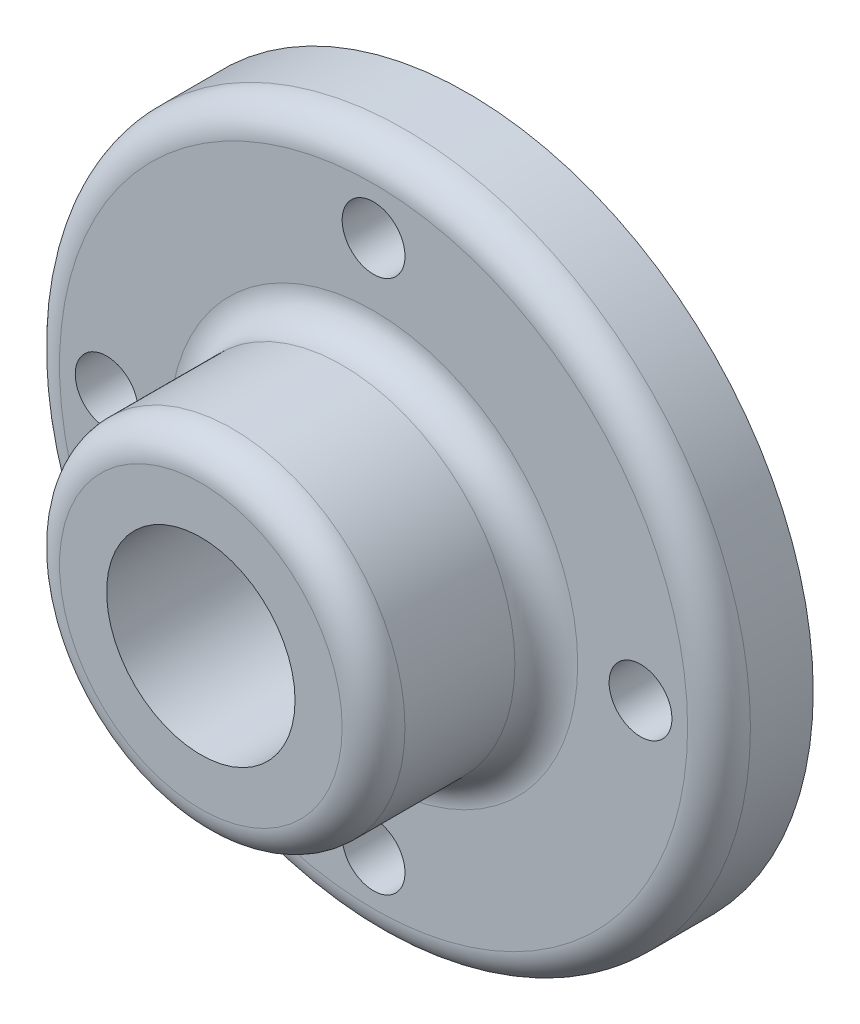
ISO-10303-21;
HEADER;
FILE_DESCRIPTION(('STEP AP214'),'2;1');
FILE_NAME('part.step','',(''),(''),'','','');
FILE_SCHEMA(('AUTOMOTIVE_DESIGN { 1 0 10303 214 1 1 1 1 }'));
ENDSEC;
DATA;
#1=APPLICATION_CONTEXT('core data for automotive mechanical design processes');
#2=APPLICATION_PROTOCOL_DEFINITION('international standard','automotive_design',2000,#1);
#3=PRODUCT_CONTEXT('',#1,'mechanical');
#4=PRODUCT('Part','Part','',(#3));
#5=PRODUCT_RELATED_PRODUCT_CATEGORY('part','',(#4));
#6=PRODUCT_DEFINITION_FORMATION('','',#4);
#7=PRODUCT_DEFINITION_CONTEXT('part definition',#1,'design');
#8=PRODUCT_DEFINITION('design','',#6,#7);
#9=PRODUCT_DEFINITION_SHAPE('','',#8);
#10=(LENGTH_UNIT() NAMED_UNIT(*) SI_UNIT(.MILLI.,.METRE.));
#11=(NAMED_UNIT(*) PLANE_ANGLE_UNIT() SI_UNIT($,.RADIAN.));
#12=(NAMED_UNIT(*) SI_UNIT($,.STERADIAN.) SOLID_ANGLE_UNIT());
#13=UNCERTAINTY_MEASURE_WITH_UNIT(LENGTH_MEASURE(1.E-05),#10,'distance_accuracy_value','');
#14=(GEOMETRIC_REPRESENTATION_CONTEXT(3) GLOBAL_UNCERTAINTY_ASSIGNED_CONTEXT((#13)) GLOBAL_UNIT_ASSIGNED_CONTEXT((#10,
#11,#12)) REPRESENTATION_CONTEXT('',''));
#15=CARTESIAN_POINT('',(0.,0.,0.));
#16=DIRECTION('',(0.,0.,1.));
#17=DIRECTION('',(1.,0.,0.));
#18=AXIS2_PLACEMENT_3D('',#15,#16,#17);
#19=CARTESIAN_POINT('',(0.,0.,0.));
#20=DIRECTION('',(0.,0.,-1.));
#21=DIRECTION('',(-1.,0.,0.));
#22=AXIS2_PLACEMENT_3D('',#19,#20,#21);
#23=PLANE('',#22);
#24=CARTESIAN_POINT('',(53.975,5.65358115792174E-13,0.));
#25=DIRECTION('',(0.,0.,1.));
#26=DIRECTION('',(0.,-1.,0.));
#27=AXIS2_PLACEMENT_3D('',#24,#25,#26);
#28=CIRCLE('',#27,6.35);
#29=CARTESIAN_POINT('',(53.9750000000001,-6.34999999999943,0.));
#30=VERTEX_POINT('',#29);
#31=EDGE_CURVE('E81',#30,#30,#28,.T.);
#32=ORIENTED_EDGE('',*,*,#31,.T.);
#33=EDGE_LOOP('',(#32));
#34=FACE_BOUND('',#33,.T.);
#35=CARTESIAN_POINT('',(0.,-53.975,0.));
#36=DIRECTION('',(0.,0.,1.));
#37=DIRECTION('',(-1.,0.,0.));
#38=AXIS2_PLACEMENT_3D('',#35,#36,#37);
#39=CIRCLE('',#38,6.35);
#40=CARTESIAN_POINT('',(-6.35,-53.975,0.));
#41=VERTEX_POINT('',#40);
#42=EDGE_CURVE('E75',#41,#41,#39,.T.);
#43=ORIENTED_EDGE('',*,*,#42,.T.);
#44=EDGE_LOOP('',(#43));
#45=FACE_BOUND('',#44,.T.);
#46=CARTESIAN_POINT('',(-53.975,-1.88452705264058E-13,0.));
#47=DIRECTION('',(0.,0.,1.));
#48=DIRECTION('',(0.,1.,0.));
#49=AXIS2_PLACEMENT_3D('',#46,#47,#48);
#50=CIRCLE('',#49,6.35);
#51=CARTESIAN_POINT('',(-53.975,6.34999999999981,0.));
#52=VERTEX_POINT('',#51);
#53=EDGE_CURVE('E69',#52,#52,#50,.T.);
#54=ORIENTED_EDGE('',*,*,#53,.T.);
#55=EDGE_LOOP('',(#54));
#56=FACE_BOUND('',#55,.T.);
#57=CARTESIAN_POINT('',(0.,53.975,0.));
#58=DIRECTION('',(0.,0.,1.));
#59=DIRECTION('',(1.,0.,0.));
#60=AXIS2_PLACEMENT_3D('',#57,#58,#59);
#61=CIRCLE('',#60,6.35);
#62=CARTESIAN_POINT('',(6.35,53.975,0.));
#63=VERTEX_POINT('',#62);
#64=EDGE_CURVE('E63',#63,#63,#61,.T.);
#65=ORIENTED_EDGE('',*,*,#64,.T.);
#66=EDGE_LOOP('',(#65));
#67=FACE_BOUND('',#66,.T.);
#68=CARTESIAN_POINT('',(0.,0.,0.));
#69=DIRECTION('',(0.,0.,1.));
#70=DIRECTION('',(1.,0.,0.));
#71=AXIS2_PLACEMENT_3D('',#68,#69,#70);
#72=CIRCLE('',#71,19.05);
#73=CARTESIAN_POINT('',(19.05,0.,0.));
#74=VERTEX_POINT('',#73);
#75=EDGE_CURVE('E59',#74,#74,#72,.T.);
#76=ORIENTED_EDGE('',*,*,#75,.T.);
#77=EDGE_LOOP('',(#76));
#78=FACE_BOUND('',#77,.T.);
#79=CARTESIAN_POINT('',(0.,0.,0.));
#80=DIRECTION('',(0.,0.,1.));
#81=DIRECTION('',(1.,0.,0.));
#82=AXIS2_PLACEMENT_3D('',#79,#80,#81);
#83=CIRCLE('',#82,69.85);
#84=CARTESIAN_POINT('',(69.85,0.,0.));
#85=VERTEX_POINT('',#84);
#86=EDGE_CURVE('E56',#85,#85,#83,.T.);
#87=ORIENTED_EDGE('',*,*,#86,.F.);
#88=EDGE_LOOP('',(#87));
#89=FACE_BOUND('',#88,.T.);
#90=ADVANCED_FACE('F30',(#34,#45,#56,#67,#78,#89),#23,.T.);
#91=CARTESIAN_POINT('',(0.,0.,0.));
#92=DIRECTION('',(0.,0.,1.));
#93=DIRECTION('',(1.,0.,0.));
#94=AXIS2_PLACEMENT_3D('',#91,#92,#93);
#95=CYLINDRICAL_SURFACE('',#94,69.85);
#96=CARTESIAN_POINT('',(0.,0.,12.7));
#97=DIRECTION('',(0.,0.,1.));
#98=DIRECTION('',(1.,0.,0.));
#99=AXIS2_PLACEMENT_3D('',#96,#97,#98);
#100=CIRCLE('',#99,69.85);
#101=CARTESIAN_POINT('',(69.85,0.,12.7));
#102=VERTEX_POINT('',#101);
#103=EDGE_CURVE('E45',#102,#102,#100,.F.);
#104=ORIENTED_EDGE('',*,*,#103,.T.);
#105=EDGE_LOOP('',(#104));
#106=FACE_BOUND('',#105,.T.);
#107=ORIENTED_EDGE('',*,*,#86,.T.);
#108=EDGE_LOOP('',(#107));
#109=FACE_BOUND('',#108,.T.);
#110=ADVANCED_FACE('F103',(#106,#109),#95,.T.);
#111=CARTESIAN_POINT('',(69.85,0.,19.05));
#112=DIRECTION('',(0.,0.,1.));
#113=DIRECTION('',(1.,0.,0.));
#114=AXIS2_PLACEMENT_3D('',#111,#112,#113);
#115=PLANE('',#114);
#116=CARTESIAN_POINT('',(53.975,5.65358115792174E-13,19.05));
#117=DIRECTION('',(0.,0.,1.));
#118=DIRECTION('',(0.,-1.,0.));
#119=AXIS2_PLACEMENT_3D('',#116,#117,#118);
#120=CIRCLE('',#119,6.35);
#121=CARTESIAN_POINT('',(53.9750000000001,-6.34999999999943,19.05));
#122=VERTEX_POINT('',#121);
#123=EDGE_CURVE('E84',#122,#122,#120,.T.);
#124=ORIENTED_EDGE('',*,*,#123,.F.);
#125=EDGE_LOOP('',(#124));
#126=FACE_BOUND('',#125,.T.);
#127=CARTESIAN_POINT('',(0.,-53.975,19.05));
#128=DIRECTION('',(0.,0.,1.));
#129=DIRECTION('',(-1.,0.,0.));
#130=AXIS2_PLACEMENT_3D('',#127,#128,#129);
#131=CIRCLE('',#130,6.35);
#132=CARTESIAN_POINT('',(-6.35,-53.975,19.05));
#133=VERTEX_POINT('',#132);
#134=EDGE_CURVE('E78',#133,#133,#131,.T.);
#135=ORIENTED_EDGE('',*,*,#134,.F.);
#136=EDGE_LOOP('',(#135));
#137=FACE_BOUND('',#136,.T.);
#138=CARTESIAN_POINT('',(-53.975,-1.88452705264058E-13,19.05));
#139=DIRECTION('',(0.,0.,1.));
#140=DIRECTION('',(0.,1.,0.));
#141=AXIS2_PLACEMENT_3D('',#138,#139,#140);
#142=CIRCLE('',#141,6.35);
#143=CARTESIAN_POINT('',(-53.975,6.34999999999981,19.05));
#144=VERTEX_POINT('',#143);
#145=EDGE_CURVE('E72',#144,#144,#142,.T.);
#146=ORIENTED_EDGE('',*,*,#145,.F.);
#147=EDGE_LOOP('',(#146));
#148=FACE_BOUND('',#147,.T.);
#149=CARTESIAN_POINT('',(0.,53.975,19.05));
#150=DIRECTION('',(0.,0.,1.));
#151=DIRECTION('',(1.,0.,0.));
#152=AXIS2_PLACEMENT_3D('',#149,#150,#151);
#153=CIRCLE('',#152,6.35);
#154=CARTESIAN_POINT('',(6.35,53.975,19.05));
#155=VERTEX_POINT('',#154);
#156=EDGE_CURVE('E66',#155,#155,#153,.T.);
#157=ORIENTED_EDGE('',*,*,#156,.F.);
#158=EDGE_LOOP('',(#157));
#159=FACE_BOUND('',#158,.T.);
#160=CARTESIAN_POINT('',(0.,0.,19.05));
#161=DIRECTION('',(0.,0.,1.));
#162=DIRECTION('',(1.,0.,0.));
#163=AXIS2_PLACEMENT_3D('',#160,#161,#162);
#164=CIRCLE('',#163,63.5);
#165=CARTESIAN_POINT('',(63.5,0.,19.05));
#166=VERTEX_POINT('',#165);
#167=EDGE_CURVE('E50',#166,#166,#164,.T.);
#168=ORIENTED_EDGE('',*,*,#167,.T.);
#169=EDGE_LOOP('',(#168));
#170=FACE_BOUND('',#169,.T.);
#171=CARTESIAN_POINT('',(0.,0.,19.05));
#172=DIRECTION('',(0.,0.,1.));
#173=DIRECTION('',(1.,0.,0.));
#174=AXIS2_PLACEMENT_3D('',#171,#172,#173);
#175=CIRCLE('',#174,41.275);
#176=CARTESIAN_POINT('',(41.275,0.,19.05));
#177=VERTEX_POINT('',#176);
#178=EDGE_CURVE('E53',#177,#177,#175,.F.);
#179=ORIENTED_EDGE('',*,*,#178,.T.);
#180=EDGE_LOOP('',(#179));
#181=FACE_BOUND('',#180,.T.);
#182=ADVANCED_FACE('F99',(#126,#137,#148,#159,#170,#181),#115,.T.);
#183=CARTESIAN_POINT('',(0.,0.,0.));
#184=DIRECTION('',(0.,0.,1.));
#185=DIRECTION('',(1.,0.,0.));
#186=AXIS2_PLACEMENT_3D('',#183,#184,#185);
#187=CYLINDRICAL_SURFACE('',#186,34.925);
#188=CARTESIAN_POINT('',(0.,0.,25.4));
#189=DIRECTION('',(0.,0.,1.));
#190=DIRECTION('',(1.,0.,0.));
#191=AXIS2_PLACEMENT_3D('',#188,#189,#190);
#192=CIRCLE('',#191,34.925);
#193=CARTESIAN_POINT('',(34.925,0.,25.4));
#194=VERTEX_POINT('',#193);
#195=EDGE_CURVE('E37',#194,#194,#192,.T.);
#196=ORIENTED_EDGE('',*,*,#195,.T.);
#197=EDGE_LOOP('',(#196));
#198=FACE_BOUND('',#197,.T.);
#199=CARTESIAN_POINT('',(0.,0.,47.625));
#200=DIRECTION('',(0.,0.,1.));
#201=DIRECTION('',(1.,0.,0.));
#202=AXIS2_PLACEMENT_3D('',#199,#200,#201);
#203=CIRCLE('',#202,34.925);
#204=CARTESIAN_POINT('',(34.925,0.,47.625));
#205=VERTEX_POINT('',#204);
#206=EDGE_CURVE('E41',#205,#205,#203,.F.);
#207=ORIENTED_EDGE('',*,*,#206,.T.);
#208=EDGE_LOOP('',(#207));
#209=FACE_BOUND('',#208,.T.);
#210=ADVANCED_FACE('F102',(#198,#209),#187,.T.);
#211=CARTESIAN_POINT('',(34.925,0.,53.975));
#212=DIRECTION('',(0.,0.,1.));
#213=DIRECTION('',(1.,0.,0.));
#214=AXIS2_PLACEMENT_3D('',#211,#212,#213);
#215=PLANE('',#214);
#216=CARTESIAN_POINT('',(0.,0.,53.975));
#217=DIRECTION('',(0.,0.,1.));
#218=DIRECTION('',(1.,0.,0.));
#219=AXIS2_PLACEMENT_3D('',#216,#217,#218);
#220=CIRCLE('',#219,28.575);
#221=CARTESIAN_POINT('',(28.575,0.,53.975));
#222=VERTEX_POINT('',#221);
#223=EDGE_CURVE('E10',#222,#222,#220,.T.);
#224=ORIENTED_EDGE('',*,*,#223,.T.);
#225=EDGE_LOOP('',(#224));
#226=FACE_BOUND('',#225,.T.);
#227=CARTESIAN_POINT('',(0.,0.,53.975));
#228=DIRECTION('',(0.,0.,1.));
#229=DIRECTION('',(1.,0.,0.));
#230=AXIS2_PLACEMENT_3D('',#227,#228,#229);
#231=CIRCLE('',#230,19.05);
#232=CARTESIAN_POINT('',(19.05,0.,53.975));
#233=VERTEX_POINT('',#232);
#234=EDGE_CURVE('E60',#233,#233,#231,.T.);
#235=ORIENTED_EDGE('',*,*,#234,.F.);
#236=EDGE_LOOP('',(#235));
#237=FACE_BOUND('',#236,.T.);
#238=ADVANCED_FACE('F138',(#226,#237),#215,.T.);
#239=CARTESIAN_POINT('',(0.,0.,0.));
#240=DIRECTION('',(0.,0.,1.));
#241=DIRECTION('',(1.,0.,0.));
#242=AXIS2_PLACEMENT_3D('',#239,#240,#241);
#243=CYLINDRICAL_SURFACE('',#242,19.05);
#244=ORIENTED_EDGE('',*,*,#75,.F.);
#245=EDGE_LOOP('',(#244));
#246=FACE_BOUND('',#245,.T.);
#247=ORIENTED_EDGE('',*,*,#234,.T.);
#248=EDGE_LOOP('',(#247));
#249=FACE_BOUND('',#248,.T.);
#250=ADVANCED_FACE('F125',(#246,#249),#243,.F.);
#251=CARTESIAN_POINT('',(0.,0.,12.7));
#252=DIRECTION('',(0.,0.,1.));
#253=DIRECTION('',(1.,0.,0.));
#254=AXIS2_PLACEMENT_3D('',#251,#252,#253);
#255=TOROIDAL_SURFACE('',#254,63.5,6.35);
#256=ORIENTED_EDGE('',*,*,#103,.F.);
#257=EDGE_LOOP('',(#256));
#258=FACE_BOUND('',#257,.T.);
#259=ORIENTED_EDGE('',*,*,#167,.F.);
#260=EDGE_LOOP('',(#259));
#261=FACE_BOUND('',#260,.T.);
#262=ADVANCED_FACE('F118',(#258,#261),#255,.T.);
#263=CARTESIAN_POINT('',(0.,0.,25.4));
#264=DIRECTION('',(0.,0.,1.));
#265=DIRECTION('',(1.,0.,0.));
#266=AXIS2_PLACEMENT_3D('',#263,#264,#265);
#267=TOROIDAL_SURFACE('',#266,41.275,6.35);
#268=ORIENTED_EDGE('',*,*,#178,.F.);
#269=EDGE_LOOP('',(#268));
#270=FACE_BOUND('',#269,.T.);
#271=ORIENTED_EDGE('',*,*,#195,.F.);
#272=EDGE_LOOP('',(#271));
#273=FACE_BOUND('',#272,.T.);
#274=ADVANCED_FACE('F115',(#270,#273),#267,.F.);
#275=CARTESIAN_POINT('',(0.,0.,47.625));
#276=DIRECTION('',(0.,0.,1.));
#277=DIRECTION('',(1.,0.,0.));
#278=AXIS2_PLACEMENT_3D('',#275,#276,#277);
#279=TOROIDAL_SURFACE('',#278,28.575,6.35);
#280=ORIENTED_EDGE('',*,*,#206,.F.);
#281=EDGE_LOOP('',(#280));
#282=FACE_BOUND('',#281,.T.);
#283=ORIENTED_EDGE('',*,*,#223,.F.);
#284=EDGE_LOOP('',(#283));
#285=FACE_BOUND('',#284,.T.);
#286=ADVANCED_FACE('F32',(#282,#285),#279,.T.);
#287=CARTESIAN_POINT('',(0.,53.975,0.));
#288=DIRECTION('',(0.,0.,1.));
#289=DIRECTION('',(1.,0.,0.));
#290=AXIS2_PLACEMENT_3D('',#287,#288,#289);
#291=CYLINDRICAL_SURFACE('',#290,6.35);
#292=ORIENTED_EDGE('',*,*,#64,.F.);
#293=EDGE_LOOP('',(#292));
#294=FACE_BOUND('',#293,.T.);
#295=ORIENTED_EDGE('',*,*,#156,.T.);
#296=EDGE_LOOP('',(#295));
#297=FACE_BOUND('',#296,.T.);
#298=ADVANCED_FACE('F123',(#294,#297),#291,.F.);
#299=CARTESIAN_POINT('',(-53.975,-1.88452705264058E-13,0.));
#300=DIRECTION('',(0.,0.,1.));
#301=DIRECTION('',(1.,0.,0.));
#302=AXIS2_PLACEMENT_3D('',#299,#300,#301);
#303=CYLINDRICAL_SURFACE('',#302,6.35);
#304=ORIENTED_EDGE('',*,*,#53,.F.);
#305=EDGE_LOOP('',(#304));
#306=FACE_BOUND('',#305,.T.);
#307=ORIENTED_EDGE('',*,*,#145,.T.);
#308=EDGE_LOOP('',(#307));
#309=FACE_BOUND('',#308,.T.);
#310=ADVANCED_FACE('F146',(#306,#309),#303,.F.);
#311=CARTESIAN_POINT('',(0.,-53.975,0.));
#312=DIRECTION('',(0.,0.,1.));
#313=DIRECTION('',(1.,0.,0.));
#314=AXIS2_PLACEMENT_3D('',#311,#312,#313);
#315=CYLINDRICAL_SURFACE('',#314,6.35);
#316=ORIENTED_EDGE('',*,*,#42,.F.);
#317=EDGE_LOOP('',(#316));
#318=FACE_BOUND('',#317,.T.);
#319=ORIENTED_EDGE('',*,*,#134,.T.);
#320=EDGE_LOOP('',(#319));
#321=FACE_BOUND('',#320,.T.);
#322=ADVANCED_FACE('F95',(#318,#321),#315,.F.);
#323=CARTESIAN_POINT('',(53.975,5.65358115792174E-13,0.));
#324=DIRECTION('',(0.,0.,1.));
#325=DIRECTION('',(1.,0.,0.));
#326=AXIS2_PLACEMENT_3D('',#323,#324,#325);
#327=CYLINDRICAL_SURFACE('',#326,6.35);
#328=ORIENTED_EDGE('',*,*,#31,.F.);
#329=EDGE_LOOP('',(#328));
#330=FACE_BOUND('',#329,.T.);
#331=ORIENTED_EDGE('',*,*,#123,.T.);
#332=EDGE_LOOP('',(#331));
#333=FACE_BOUND('',#332,.T.);
#334=ADVANCED_FACE('F92',(#330,#333),#327,.F.);
#335=CLOSED_SHELL('',(#90,#110,#182,#210,#238,#250,#262,#274,#286,#298,#310,#322,#334));
#336=MANIFOLD_SOLID_BREP('B2',#335);
#337=ADVANCED_BREP_SHAPE_REPRESENTATION('',(#18,#336),#14);
#338=SHAPE_DEFINITION_REPRESENTATION(#9,#337);
ENDSEC;
END-ISO-10303-21;
